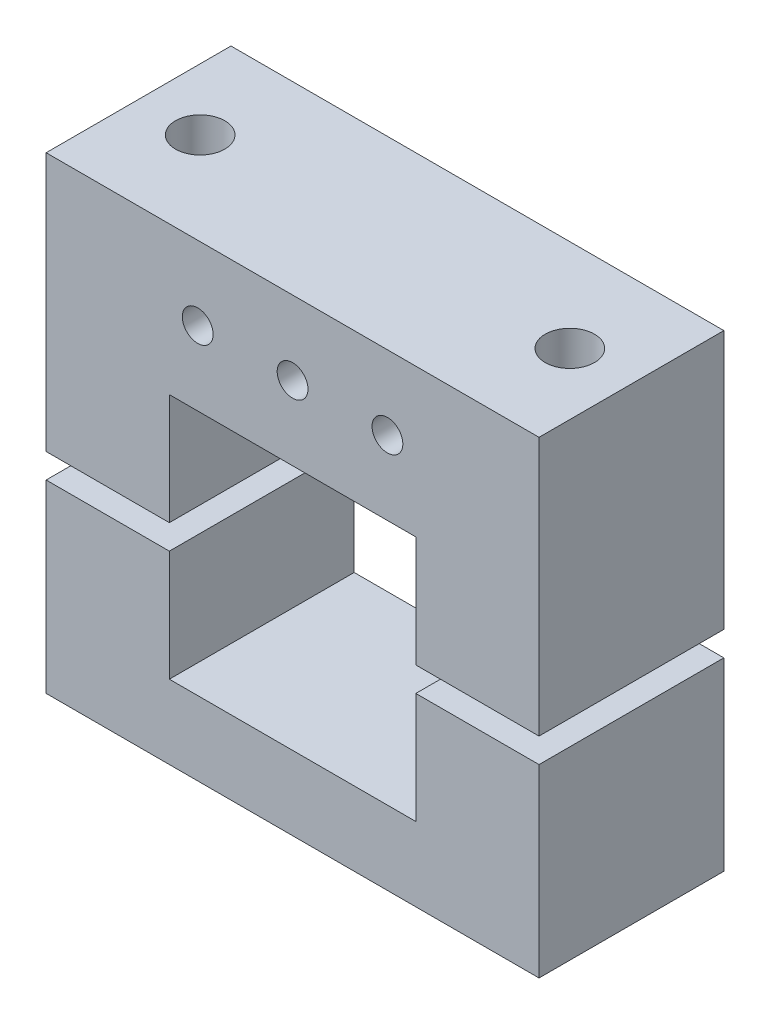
from build123d import *

# Parameters (mm, degrees)
SKETCH1_R             = 1.25
BOSS_EXTRUDE1_DEPTH   = 15
BOSS_EXTRUDE1_2_DEPTH = 15
SKETCH4_R             = 2
CUT_EXTRUDE1_DEPTH    = 66


with BuildPart() as part:
    # Sketch1 → Boss-Extrude1 (new body)
    with BuildSketch(Plane.XY):
        Polygon((-402.389529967, 11.294684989), (-382.389529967, 11.294684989), (-382.389529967, 2.294684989), (-372.389529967, 2.294684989), (-372.389529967, 23.294684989), (-392.389529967, 23.294684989), (-412.389529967, 23.294684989), (-412.389529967, 2.294684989), (-402.389529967, 2.294684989), align=None)
        with Locations((-384.691589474, 17.294684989)):
            Circle(SKETCH1_R, mode=Mode.SUBTRACT)
        with Locations((-392.389529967, 17.294684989)):
            Circle(SKETCH1_R, mode=Mode.SUBTRACT)
        with Locations(Location((-400.087470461, 17.294684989, 0), (0, 0, 180))):
            Circle(SKETCH1_R, mode=Mode.SUBTRACT)
    extrude(amount=BOSS_EXTRUDE1_DEPTH)


with BuildPart() as body_2:
    # Sketch1 → Boss-Extrude1 2 (new body)
    with BuildSketch(Plane.XY):
        Polygon((-382.389529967, -8.705315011), (-402.389529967, -8.705315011), (-402.389529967, 0.294684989), (-412.389529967, 0.294684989), (-412.389529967, -14.705315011), (-372.389529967, -14.705315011), (-372.389529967, 0.294684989), (-382.389529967, 0.294684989), align=None)
    extrude(amount=BOSS_EXTRUDE1_2_DEPTH)


with BuildPart() as cut_extrude1_tool:
    # Sketch4 → Cut-Extrude1 (new body)
    with BuildSketch(Plane(origin=(0, 23.294684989, 0), x_dir=(-1, 0, 0), z_dir=(0, 1, 0))):
        with Locations(Location((407.389529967, 7.5, 0), (0, 0, 90))):
            Circle(SKETCH4_R)
        with Locations(Location((377.389529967, 7.5, 0), (0, 0, 90))):
            Circle(SKETCH4_R)
    extrude(amount=-CUT_EXTRUDE1_DEPTH)


with BuildPart() as part_1:
    add(part.part)

    # Cut-Extrude1: cut by cut_extrude1_tool
    add(cut_extrude1_tool.part, mode=Mode.SUBTRACT)


with BuildPart() as body_2_1:
    add(body_2.part)

    # Cut-Extrude1: cut by cut_extrude1_tool
    add(cut_extrude1_tool.part, mode=Mode.SUBTRACT)


solid = Compound([part_1.part, body_2_1.part])
